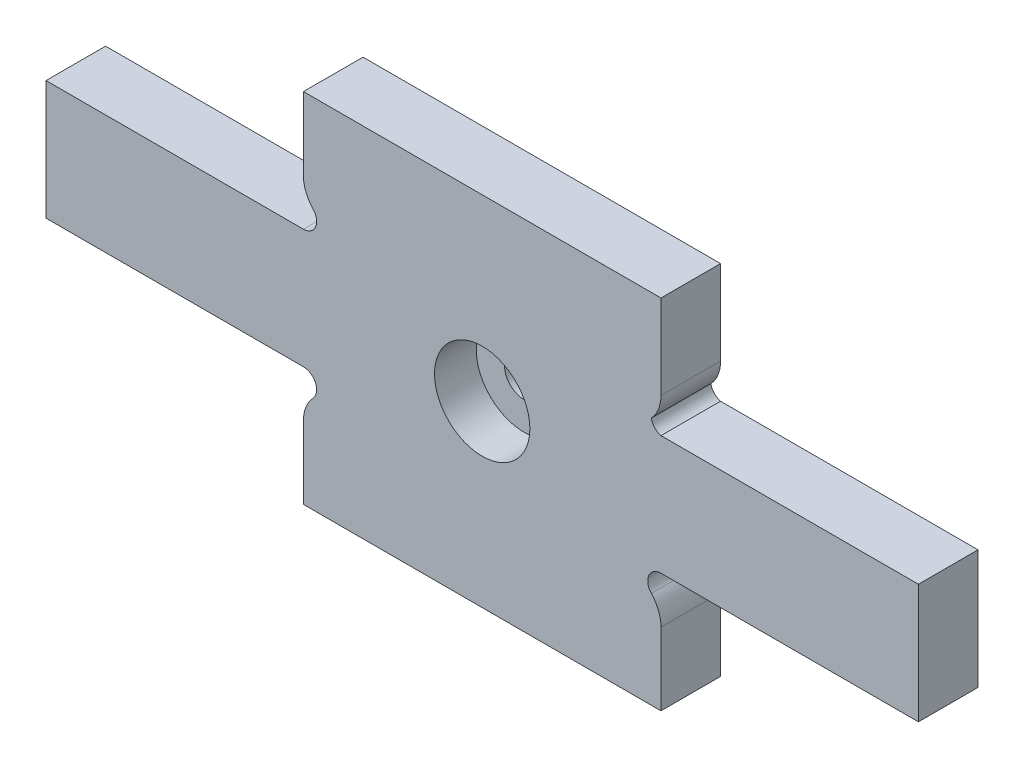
from build123d import *

# Parameters (mm, degrees)
BOSS_EXTRU_1_DEPTH      = 10
ESQUISSE3_R             = 3.25
ENL_V_MAT_EXTRU_2_DEPTH = 10
ESQUISSE2_R             = 8
ENL_V_MAT_EXTRU_1_DEPTH = 7


with BuildPart() as part:
    # Esquisse1 → Boss.-Extru.1 (new body)
    with BuildSketch(Plane.XY):
        with BuildLine():
            Line((30, -10), (73.2, -10))
            Line((73.2, -10), (73.2, 10))
            Line((73.2, 10), (30, 10))
            ThreePointArc((30, 10), (28.937806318, 10.633704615), (28.379562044, 11.737425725))
            ThreePointArc((28.379562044, 11.737425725), (29.580204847, 13.633737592), (30, 15.838576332))
            Line((30, 15.838576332), (30, 30))
            Line((30, 30), (-30, 30))
            Line((-30, 30), (-30, 17.374003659))
            ThreePointArc((-30, 17.374003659), (-29.50020143, 15.417393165), (-28.379562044, 13.737425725))
            ThreePointArc((-28.379562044, 13.737425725), (-27.963202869, 11.336904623), (-30, 10))
            Line((-30, 10), (-73.2, 10))
            Line((-73.2, 10), (-73.2, -10))
            Line((-73.2, -10), (-30, -10))
            ThreePointArc((-30, -10), (-27.963202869, -11.336904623), (-28.379562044, -13.737425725))
            ThreePointArc((-28.379562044, -13.737425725), (-29.580204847, -15.633737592), (-30, -17.838576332))
            Line((-30, -17.838576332), (-30, -30))
            Line((-30, -30), (30, -30))
            Line((30, -30), (30, -17.838576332))
            ThreePointArc((30, -17.838576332), (29.580204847, -15.633737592), (28.379562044, -13.737425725))
            ThreePointArc((28.379562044, -13.737425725), (27.963202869, -11.336904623), (30, -10))
        make_face()
    extrude(amount=BOSS_EXTRU_1_DEPTH)

    # Esquisse3 → Enl_v. mat.-Extru.2 (cut)
    with BuildSketch(Plane.XY.offset(10)):
        Circle(ESQUISSE3_R)
    extrude(amount=-ENL_V_MAT_EXTRU_2_DEPTH, mode=Mode.SUBTRACT)

    # Esquisse2 → Enl_v. mat.-Extru.1 (cut)
    with BuildSketch(Plane.XY.offset(10)):
        Circle(ESQUISSE2_R)
    extrude(amount=-ENL_V_MAT_EXTRU_1_DEPTH, mode=Mode.SUBTRACT)


solid = part.part
